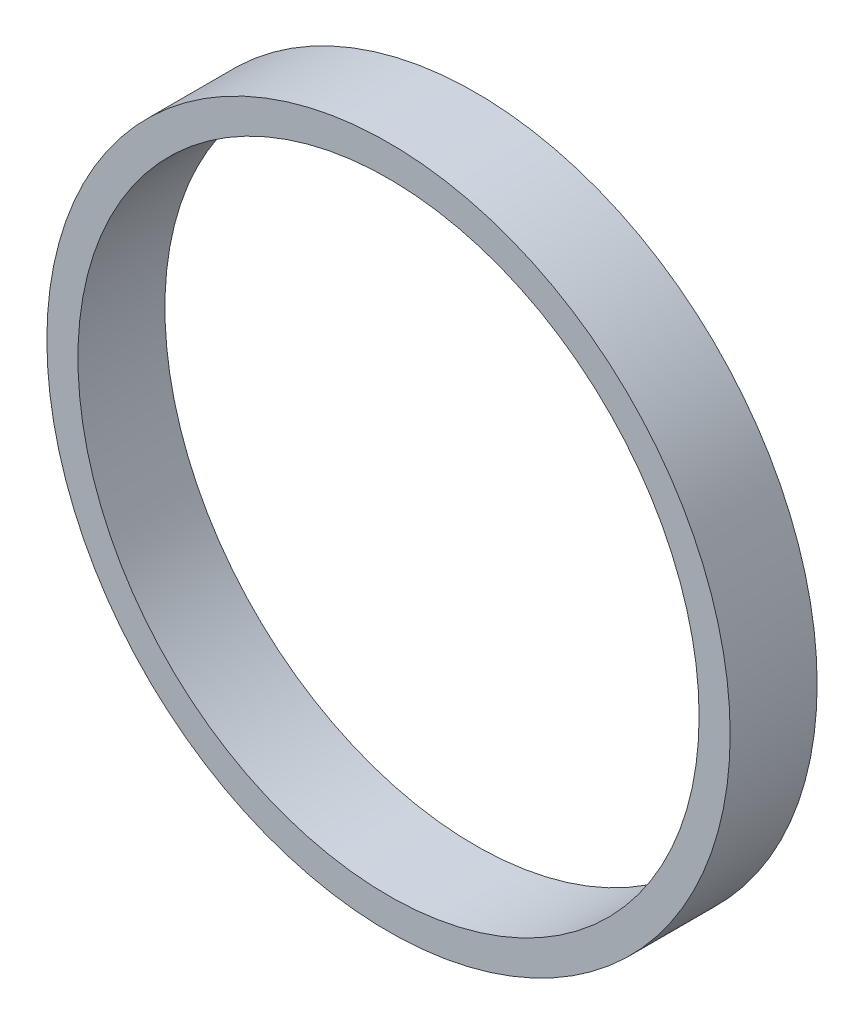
from build123d import *

# Parameters (mm, degrees)
SKETCH1_R      = 55
SKETCH1_R_2    = 50
EXTRUDE1_DEPTH = 14


with BuildPart() as part:
    # Sketch1 → Extrude1 (new body)
    with BuildSketch(Plane.XY):
        Circle(SKETCH1_R)
        Circle(SKETCH1_R_2, mode=Mode.SUBTRACT)
    extrude(amount=EXTRUDE1_DEPTH)


solid = part.part
